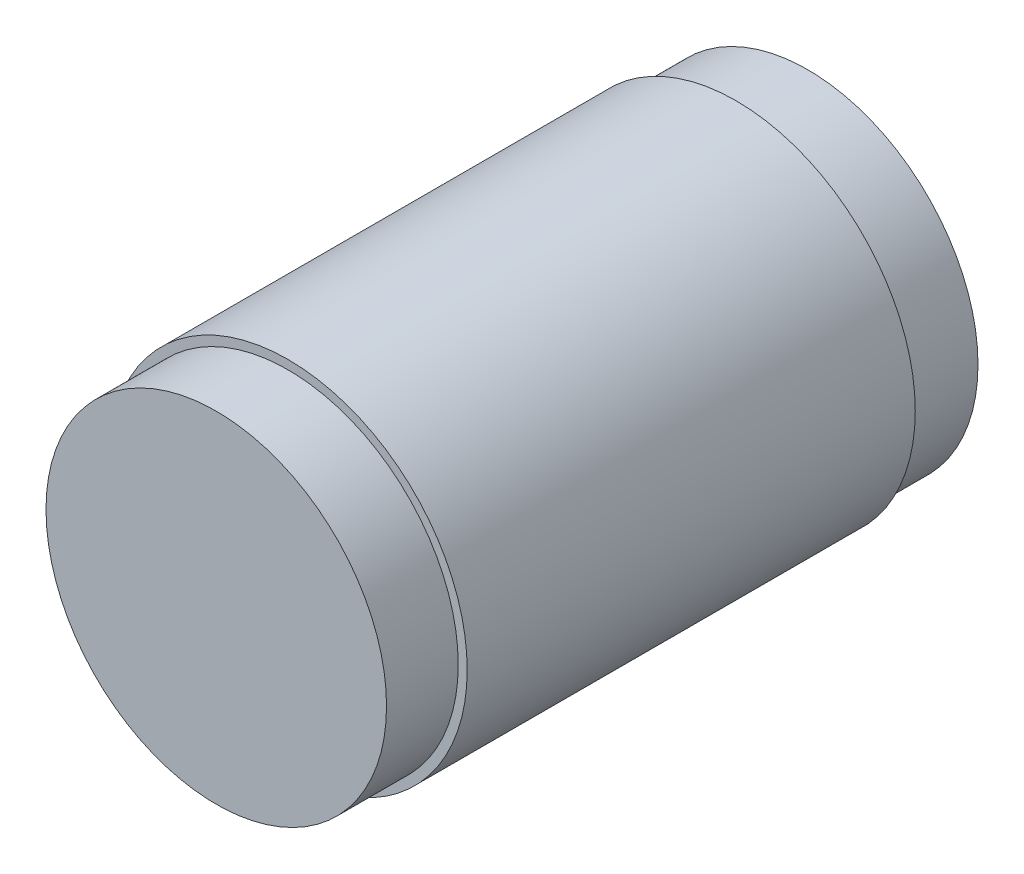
from build123d import *


with BuildPart() as part:
    # Sketch1 → Revolve1 (revolve)
    with BuildSketch(Plane(origin=(0, 0, 0), x_dir=(0, 0, -1), z_dir=(1, 0, 0)), mode=Mode.PRIVATE) as revolve1_sk:
        Polygon((-33.623416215, -8.782506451), (-0.623416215, -8.782506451), (-0.623416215, 0.717493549), (-4.623416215, 0.717493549), (-4.623416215, 1.217493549), (-29.623416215, 1.217493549), (-29.623416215, 0.717493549), (-33.623416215, 0.717493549), align=None)
    revolve(revolve1_sk.sketch.rotate(Axis((0, -8.782506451, 33.623416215), (0, 0, -1)), 90), axis=Axis((0, -8.782506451, 33.623416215), (0, 0, -1)))


solid = part.part
